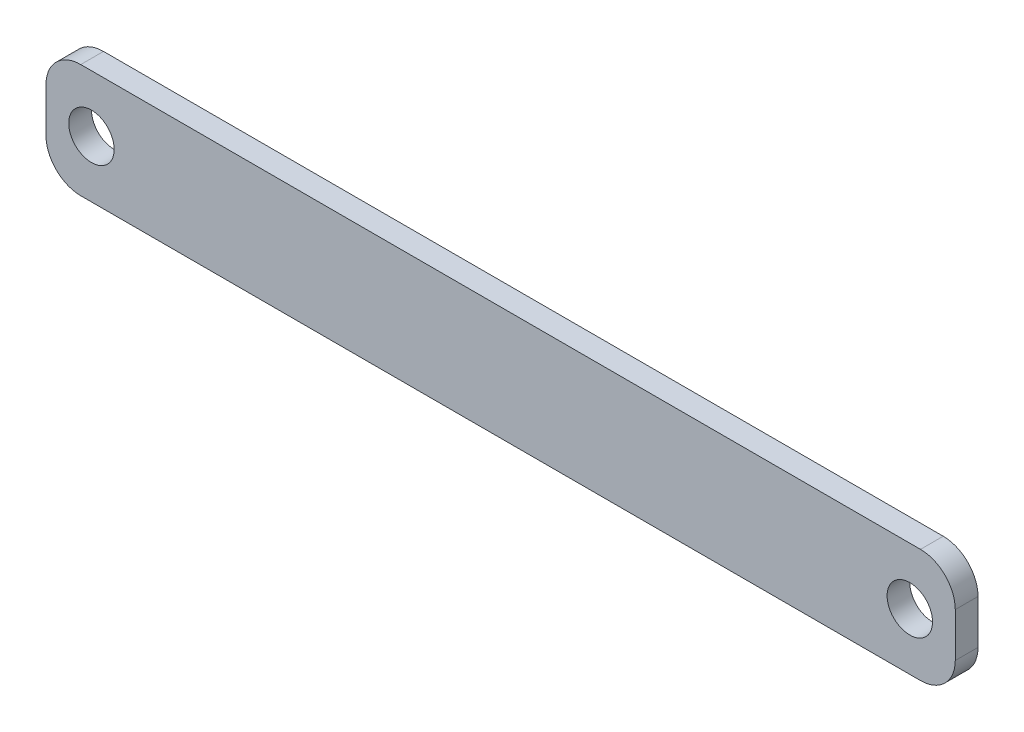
from build123d import *

# Parameters (mm, degrees)
SKETCH1_W           = 50.8
SKETCH1_H           = 12.7
SKETCH1_R           = 2.54
BOSS_EXTRUDE1_DEPTH = 2.54
FILLET1_R           = 3.8862


with BuildPart() as part:
    # Sketch1 → Boss-Extrude1 (new body)
    # profile 1 of 2: a face of its own
    with BuildSketch(Plane.XY):
        with Locations((-25.4, 6.35)):
            Rectangle(SKETCH1_W, SKETCH1_H)
        with Locations((-45.72, 6.35)):
            Circle(SKETCH1_R, mode=Mode.SUBTRACT)
    # profile 2 of 2: a face of its own
    with BuildSketch(Plane.XY):
        with Locations((25.4, 6.35)):
            Rectangle(SKETCH1_W, SKETCH1_H)
        with Locations((45.72, 6.35)):
            Circle(SKETCH1_R, mode=Mode.SUBTRACT)
    extrude(amount=BOSS_EXTRUDE1_DEPTH)

    # Fillet1
    fillet1_edges = [part.edges().sort_by_distance(p)[0] for p in [
        (-50.8, 12.7, 1.27),
        (50.8, 12.7, 1.27),
        (50.8, 0, 1.27),
        (-50.8, 0, 1.27),
    ]]
    fillet(fillet1_edges, radius=FILLET1_R)


solid = part.part
